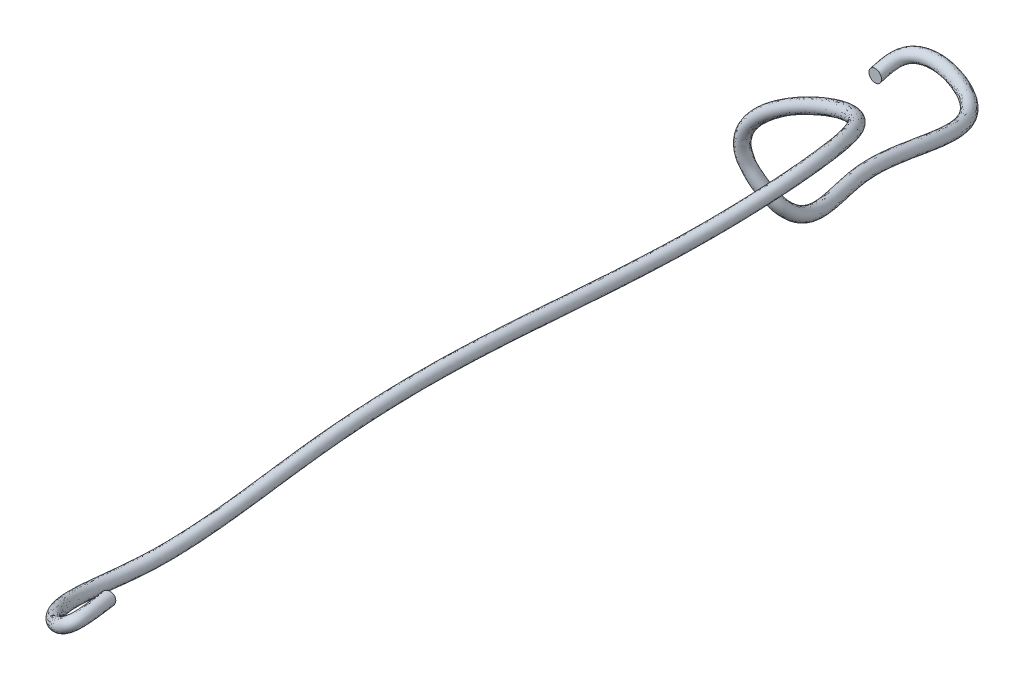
ISO-10303-21;
HEADER;
FILE_DESCRIPTION(('STEP AP214'),'2;1');
FILE_NAME('part.step','',(''),(''),'','','');
FILE_SCHEMA(('AUTOMOTIVE_DESIGN { 1 0 10303 214 1 1 1 1 }'));
ENDSEC;
DATA;
#1=APPLICATION_CONTEXT('core data for automotive mechanical design processes');
#2=APPLICATION_PROTOCOL_DEFINITION('international standard','automotive_design',2000,#1);
#3=PRODUCT_CONTEXT('',#1,'mechanical');
#4=PRODUCT('Part','Part','',(#3));
#5=PRODUCT_RELATED_PRODUCT_CATEGORY('part','',(#4));
#6=PRODUCT_DEFINITION_FORMATION('','',#4);
#7=PRODUCT_DEFINITION_CONTEXT('part definition',#1,'design');
#8=PRODUCT_DEFINITION('design','',#6,#7);
#9=PRODUCT_DEFINITION_SHAPE('','',#8);
#10=(LENGTH_UNIT() NAMED_UNIT(*) SI_UNIT(.MILLI.,.METRE.));
#11=(NAMED_UNIT(*) PLANE_ANGLE_UNIT() SI_UNIT($,.RADIAN.));
#12=(NAMED_UNIT(*) SI_UNIT($,.STERADIAN.) SOLID_ANGLE_UNIT());
#13=UNCERTAINTY_MEASURE_WITH_UNIT(LENGTH_MEASURE(1.E-05),#10,'distance_accuracy_value','');
#14=(GEOMETRIC_REPRESENTATION_CONTEXT(3) GLOBAL_UNCERTAINTY_ASSIGNED_CONTEXT((#13)) GLOBAL_UNIT_ASSIGNED_CONTEXT((#10,
#11,#12)) REPRESENTATION_CONTEXT('',''));
#15=CARTESIAN_POINT('',(0.,0.,0.));
#16=DIRECTION('',(0.,0.,1.));
#17=DIRECTION('',(1.,0.,0.));
#18=AXIS2_PLACEMENT_3D('',#15,#16,#17);
#19=CARTESIAN_POINT('',(-30.8050491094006,-25.8101111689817,-91.7256134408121));
#20=DIRECTION('',(0.,0.,1.));
#21=DIRECTION('',(1.,0.,0.));
#22=AXIS2_PLACEMENT_3D('',#19,#20,#21);
#23=PLANE('',#22);
#24=CARTESIAN_POINT('',(-30.8050491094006,-25.3101111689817,-91.7256134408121));
#25=DIRECTION('',(0.,0.,-1.));
#26=DIRECTION('',(-1.,0.,0.));
#27=AXIS2_PLACEMENT_3D('',#24,#25,#26);
#28=CIRCLE('',#27,0.5);
#29=CARTESIAN_POINT('',(-31.3050491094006,-25.3101111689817,-91.7256134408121));
#30=VERTEX_POINT('',#29);
#31=EDGE_CURVE('E46',#30,#30,#28,.T.);
#32=ORIENTED_EDGE('',*,*,#31,.F.);
#33=EDGE_LOOP('',(#32));
#34=FACE_BOUND('',#33,.T.);
#35=ADVANCED_FACE('F42',(#34),#23,.T.);
#36=CARTESIAN_POINT('',(-0.468553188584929,-0.0688810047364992,0.160353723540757));
#37=DIRECTION('',(0.298607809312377,0.159345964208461,0.940979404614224));
#38=DIRECTION('',(0.953158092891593,0.,-0.302472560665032));
#39=AXIS2_PLACEMENT_3D('',#36,#37,#38);
#40=PLANE('',#39);
#41=CARTESIAN_POINT('',(0.,0.,0.));
#42=DIRECTION('',(0.298607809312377,0.159345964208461,0.940979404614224));
#43=DIRECTION('',(0.953158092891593,0.,-0.302472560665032));
#44=AXIS2_PLACEMENT_3D('',#41,#42,#43);
#45=CIRCLE('',#44,0.5);
#46=CARTESIAN_POINT('',(0.476579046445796,0.,-0.151236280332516));
#47=VERTEX_POINT('',#46);
#48=EDGE_CURVE('E11',#47,#47,#45,.T.);
#49=ORIENTED_EDGE('',*,*,#48,.F.);
#50=EDGE_LOOP('',(#49));
#51=FACE_BOUND('',#50,.T.);
#52=ADVANCED_FACE('F44',(#51),#40,.F.);
#53=CARTESIAN_POINT('',(-30.8050491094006,-24.8101111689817,-91.7256134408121));
#54=CARTESIAN_POINT('',(-30.8286368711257,-24.7723173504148,-91.9692451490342));
#55=CARTESIAN_POINT('',(-30.8758123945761,-24.6967297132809,-92.4565085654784));
#56=CARTESIAN_POINT('',(-30.8744043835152,-24.5913158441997,-93.0790604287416));
#57=CARTESIAN_POINT('',(-30.7886345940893,-24.5189352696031,-93.4355183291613));
#58=CARTESIAN_POINT('',(-30.6783812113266,-24.4642014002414,-93.6649266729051));
#59=CARTESIAN_POINT('',(-30.5604836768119,-24.4194596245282,-93.8271355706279));
#60=CARTESIAN_POINT('',(-30.3648505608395,-24.3632351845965,-93.9876531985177));
#61=CARTESIAN_POINT('',(-30.1283369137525,-24.3072269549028,-94.1062951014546));
#62=CARTESIAN_POINT('',(-29.8216098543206,-24.2442956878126,-94.1960352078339));
#63=CARTESIAN_POINT('',(-29.431369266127,-24.1736732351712,-94.2432498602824));
#64=CARTESIAN_POINT('',(-28.9487570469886,-24.0946303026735,-94.2341034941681));
#65=CARTESIAN_POINT('',(-28.0670946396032,-23.9595610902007,-94.1253856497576));
#66=CARTESIAN_POINT('',(-26.6687793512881,-23.7600240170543,-93.7345660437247));
#67=CARTESIAN_POINT('',(-25.1581597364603,-23.5399161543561,-93.0663809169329));
#68=CARTESIAN_POINT('',(-24.212156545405,-23.3728853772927,-92.4770927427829));
#69=CARTESIAN_POINT('',(-23.4780428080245,-23.2175068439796,-91.9189234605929));
#70=CARTESIAN_POINT('',(-22.7738361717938,-23.0183862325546,-91.1925204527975));
#71=CARTESIAN_POINT('',(-22.1204567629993,-22.7572820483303,-90.2418198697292));
#72=CARTESIAN_POINT('',(-21.6659360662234,-22.4865540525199,-89.2365545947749));
#73=CARTESIAN_POINT('',(-20.9904034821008,-21.8484080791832,-86.7753062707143));
#74=CARTESIAN_POINT('',(-21.0838696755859,-21.1383771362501,-83.7580490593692));
#75=CARTESIAN_POINT('',(-20.2613901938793,-20.3785325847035,-79.4104181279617));
#76=CARTESIAN_POINT('',(-19.1681192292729,-20.0722868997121,-76.7595582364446));
#77=CARTESIAN_POINT('',(-18.7323638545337,-19.5667399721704,-74.7807531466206));
#78=CARTESIAN_POINT('',(-18.5769533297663,-19.2544110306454,-73.9433356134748));
#79=CARTESIAN_POINT('',(-18.5566447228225,-18.9076468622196,-73.2977823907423));
#80=CARTESIAN_POINT('',(-18.6422615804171,-18.539907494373,-72.820516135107));
#81=CARTESIAN_POINT('',(-18.7771812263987,-18.2577726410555,-72.5424068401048));
#82=CARTESIAN_POINT('',(-18.9289179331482,-17.9690211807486,-72.3402827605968));
#83=CARTESIAN_POINT('',(-19.0909133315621,-17.6331044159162,-72.1546348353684));
#84=CARTESIAN_POINT('',(-19.2233126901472,-16.8968732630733,-71.8000273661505));
#85=CARTESIAN_POINT('',(-19.9112888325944,-16.2154765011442,-71.6454537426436));
#86=CARTESIAN_POINT('',(-20.0233939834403,-15.5427149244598,-71.4054093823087));
#87=CARTESIAN_POINT('',(-20.0946302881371,-15.0376661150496,-71.2778351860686));
#88=CARTESIAN_POINT('',(-20.1806289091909,-14.6387475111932,-71.2385835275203));
#89=CARTESIAN_POINT('',(-20.1212305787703,-14.1082047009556,-71.174742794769));
#90=CARTESIAN_POINT('',(-19.9265559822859,-13.4756371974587,-71.1270874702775));
#91=CARTESIAN_POINT('',(-19.4774638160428,-12.726208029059,-71.0882327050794));
#92=CARTESIAN_POINT('',(-18.6765131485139,-11.8743263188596,-71.046171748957));
#93=CARTESIAN_POINT('',(-17.1667635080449,-10.6907283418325,-70.9475558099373));
#94=CARTESIAN_POINT('',(-15.1084138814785,-9.51305495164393,-70.5500554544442));
#95=CARTESIAN_POINT('',(-12.9287654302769,-8.20780046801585,-69.9668022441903));
#96=CARTESIAN_POINT('',(-11.2652114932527,-7.31080506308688,-69.4339101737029));
#97=CARTESIAN_POINT('',(-10.2908139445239,-6.78345678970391,-68.9261374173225));
#98=CARTESIAN_POINT('',(-9.40481773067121,-6.31796186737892,-68.3380846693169));
#99=CARTESIAN_POINT('',(-8.42987075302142,-5.82844731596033,-67.5171038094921));
#100=CARTESIAN_POINT('',(-7.39154733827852,-5.23658369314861,-65.9428050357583));
#101=CARTESIAN_POINT('',(-6.81061296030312,-4.95277088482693,-64.5612487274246));
#102=CARTESIAN_POINT('',(-6.39154035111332,-4.75650017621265,-63.1321345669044));
#103=CARTESIAN_POINT('',(-6.14838655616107,-4.64425039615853,-61.5508842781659));
#104=CARTESIAN_POINT('',(-6.03563306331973,-4.70384303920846,-58.2600952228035));
#105=CARTESIAN_POINT('',(-6.25607066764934,-5.04485144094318,-54.9090850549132));
#106=CARTESIAN_POINT('',(-6.56105774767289,-5.30376674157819,-47.8753059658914));
#107=CARTESIAN_POINT('',(-6.66746945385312,-4.72866466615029,-40.9154716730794));
#108=CARTESIAN_POINT('',(-6.67902420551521,-4.19774143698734,-31.4857506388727));
#109=CARTESIAN_POINT('',(-6.63536273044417,-4.42603247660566,-23.6467166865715));
#110=CARTESIAN_POINT('',(-6.10914279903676,-5.26872859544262,-15.5931010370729));
#111=CARTESIAN_POINT('',(-5.87838146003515,-5.54547443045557,-9.88689501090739));
#112=CARTESIAN_POINT('',(-6.08225408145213,-5.29024865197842,-6.37330513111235));
#113=CARTESIAN_POINT('',(-6.05684395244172,-4.88654097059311,-4.22314964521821));
#114=CARTESIAN_POINT('',(-5.70341329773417,-4.41080925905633,-2.45187692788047));
#115=CARTESIAN_POINT('',(-5.01843890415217,-3.77318614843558,-0.784804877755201));
#116=CARTESIAN_POINT('',(-4.2507552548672,-3.17993970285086,0.377160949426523));
#117=CARTESIAN_POINT('',(-3.27555871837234,-2.53205218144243,1.52090268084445));
#118=CARTESIAN_POINT('',(-2.34209964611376,-1.99230819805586,2.37408571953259));
#119=CARTESIAN_POINT('',(-1.31283970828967,-1.35657912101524,3.07890306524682));
#120=CARTESIAN_POINT('',(-0.763691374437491,-1.01150074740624,3.34801365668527));
#121=CARTESIAN_POINT('',(-0.348458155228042,-0.742708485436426,3.45609770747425));
#122=CARTESIAN_POINT('',(-0.0947504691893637,-0.574341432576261,3.46694363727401));
#123=CARTESIAN_POINT('',(0.105507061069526,-0.437817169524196,3.42678630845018));
#124=CARTESIAN_POINT('',(0.252317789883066,-0.335466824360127,3.36647929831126));
#125=CARTESIAN_POINT('',(0.390727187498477,-0.236203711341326,3.27089475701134));
#126=CARTESIAN_POINT('',(0.512230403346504,-0.145563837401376,3.13931213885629));
#127=CARTESIAN_POINT('',(0.577748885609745,-0.094113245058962,3.02878530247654));
#128=CARTESIAN_POINT('',(0.631772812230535,-0.0496149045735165,2.91466446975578));
#129=CARTESIAN_POINT('',(0.675681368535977,-0.0110887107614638,2.79559063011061));
#130=CARTESIAN_POINT('',(0.717008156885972,0.0298866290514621,2.61678863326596));
#131=CARTESIAN_POINT('',(0.741622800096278,0.0601164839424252,2.43259955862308));
#132=CARTESIAN_POINT('',(0.764366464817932,0.102975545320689,2.06083198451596));
#133=CARTESIAN_POINT('',(0.712691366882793,0.128215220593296,1.2523722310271));
#134=CARTESIAN_POINT('',(0.563919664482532,0.0920584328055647,0.391492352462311));
#135=CARTESIAN_POINT('',(0.468553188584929,0.0688810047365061,-0.160353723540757));
#136=CARTESIAN_POINT('',(-29.8050491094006,-24.8101111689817,-91.7256134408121));
#137=CARTESIAN_POINT('',(-29.828800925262,-24.7736602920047,-91.961558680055));
#138=CARTESIAN_POINT('',(-29.8763045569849,-24.7007585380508,-92.4334491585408));
#139=CARTESIAN_POINT('',(-29.8772280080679,-24.6151547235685,-92.9389738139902));
#140=CARTESIAN_POINT('',(-29.8450286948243,-24.5861972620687,-93.0878012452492));
#141=CARTESIAN_POINT('',(-29.8321294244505,-24.5732596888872,-93.1353632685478));
#142=CARTESIAN_POINT('',(-29.8355416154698,-24.5678488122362,-93.1375316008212));
#143=CARTESIAN_POINT('',(-29.8347533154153,-24.5588998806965,-93.1518168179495));
#144=CARTESIAN_POINT('',(-29.7932612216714,-24.5388268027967,-93.1861381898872));
#145=CARTESIAN_POINT('',(-29.6732992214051,-24.5012126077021,-93.2353848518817));
#146=CARTESIAN_POINT('',(-29.4427449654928,-24.442340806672,-93.2763492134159));
#147=CARTESIAN_POINT('',(-29.0890444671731,-24.3610982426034,-93.2782680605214));
#148=CARTESIAN_POINT('',(-28.3712621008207,-24.201655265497,-93.1974316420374));
#149=CARTESIAN_POINT('',(-27.1191741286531,-23.9199578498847,-92.8458434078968));
#150=CARTESIAN_POINT('',(-25.732098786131,-23.5385060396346,-92.2416799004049));
#151=CARTESIAN_POINT('',(-24.8744377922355,-23.3178019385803,-91.7277725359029));
#152=CARTESIAN_POINT('',(-24.2165534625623,-23.1524486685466,-91.2448678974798));
#153=CARTESIAN_POINT('',(-23.5979139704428,-23.0125359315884,-90.6162534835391));
#154=CARTESIAN_POINT('',(-23.0276495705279,-22.803268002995,-89.8125195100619));
#155=CARTESIAN_POINT('',(-22.6221804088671,-22.594094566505,-88.9493017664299));
#156=CARTESIAN_POINT('',(-21.9757086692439,-22.1301874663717,-86.75493836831));
#157=CARTESIAN_POINT('',(-22.0529058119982,-21.4275494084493,-83.7664753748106));
#158=CARTESIAN_POINT('',(-21.253270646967,-20.4326634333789,-79.2592395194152));
#159=CARTESIAN_POINT('',(-20.1604818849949,-20.0621937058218,-76.5011153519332));
#160=CARTESIAN_POINT('',(-19.6584389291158,-19.8727278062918,-74.546246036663));
#161=CARTESIAN_POINT('',(-19.4860678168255,-19.6234387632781,-73.7455464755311));
#162=CARTESIAN_POINT('',(-19.4421427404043,-19.3497642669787,-73.1502823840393));
#163=CARTESIAN_POINT('',(-19.4983868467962,-19.0567202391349,-72.7284934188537));
#164=CARTESIAN_POINT('',(-19.5810098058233,-18.83756901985,-72.4695218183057));
#165=CARTESIAN_POINT('',(-19.7247703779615,-18.5900351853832,-72.299984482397));
#166=CARTESIAN_POINT('',(-19.8912683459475,-18.2604731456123,-72.2049383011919));
#167=CARTESIAN_POINT('',(-19.960607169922,-17.2841430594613,-72.4442062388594));
#168=CARTESIAN_POINT('',(-20.7391257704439,-16.7772339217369,-71.9150078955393));
#169=CARTESIAN_POINT('',(-20.7205778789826,-15.8457547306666,-72.0261200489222));
#170=CARTESIAN_POINT('',(-20.759768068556,-15.1786908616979,-72.0334747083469));
#171=CARTESIAN_POINT('',(-20.9025795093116,-14.7119205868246,-71.9229369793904));
#172=CARTESIAN_POINT('',(-20.8319475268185,-14.0363028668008,-71.8811701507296));
#173=CARTESIAN_POINT('',(-20.602414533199,-13.2636243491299,-71.8368232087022));
#174=CARTESIAN_POINT('',(-20.068737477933,-12.4017456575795,-71.8322687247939));
#175=CARTESIAN_POINT('',(-19.1521508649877,-11.5146676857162,-71.8501471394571));
#176=CARTESIAN_POINT('',(-17.452793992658,-10.3882073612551,-71.8881502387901));
#177=CARTESIAN_POINT('',(-14.998407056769,-9.71249006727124,-71.6132037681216));
#178=CARTESIAN_POINT('',(-12.579286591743,-8.81772415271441,-70.7017341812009));
#179=CARTESIAN_POINT('',(-10.8332303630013,-8.01289271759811,-70.0061830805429));
#180=CARTESIAN_POINT('',(-9.79758702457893,-7.51428067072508,-69.4005343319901));
#181=CARTESIAN_POINT('',(-8.83537861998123,-7.02222706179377,-68.7644402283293));
#182=CARTESIAN_POINT('',(-7.74715275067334,-6.42704464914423,-67.9510741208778));
#183=CARTESIAN_POINT('',(-6.58948290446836,-5.72917443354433,-66.3117968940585));
#184=CARTESIAN_POINT('',(-5.92586581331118,-5.27053821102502,-64.8982256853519));
#185=CARTESIAN_POINT('',(-5.45773337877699,-4.99315344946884,-63.4143360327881));
#186=CARTESIAN_POINT('',(-5.20786646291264,-4.93289168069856,-61.7415598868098));
#187=CARTESIAN_POINT('',(-5.12798067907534,-5.12026659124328,-58.3612333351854));
#188=CARTESIAN_POINT('',(-5.34206588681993,-5.44922756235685,-54.9821731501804));
#189=CARTESIAN_POINT('',(-5.62099071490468,-5.63736635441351,-47.9270358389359));
#190=CARTESIAN_POINT('',(-5.72516199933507,-5.07541625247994,-40.9616262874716));
#191=CARTESIAN_POINT('',(-5.80009522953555,-4.65446590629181,-31.6123146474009));
#192=CARTESIAN_POINT('',(-5.80543523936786,-4.95736664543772,-23.8484552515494));
#193=CARTESIAN_POINT('',(-5.22756559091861,-5.69801420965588,-15.7791876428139));
#194=CARTESIAN_POINT('',(-4.8535687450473,-5.72136080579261,-9.95874552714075));
#195=CARTESIAN_POINT('',(-5.12976228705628,-5.61317664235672,-6.43626864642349));
#196=CARTESIAN_POINT('',(-5.23403212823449,-5.45938347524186,-4.31756479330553));
#197=CARTESIAN_POINT('',(-4.94655020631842,-5.05058237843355,-2.59088645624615));
#198=CARTESIAN_POINT('',(-4.33249587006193,-4.47884626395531,-0.97039879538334));
#199=CARTESIAN_POINT('',(-3.61947493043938,-3.93351922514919,0.183864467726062));
#200=CARTESIAN_POINT('',(-2.66492950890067,-3.28185678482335,1.26761494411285));
#201=CARTESIAN_POINT('',(-1.71047417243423,-2.68304485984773,2.0146485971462));
#202=CARTESIAN_POINT('',(-0.724884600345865,-2.04445621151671,2.65265027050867));
#203=CARTESIAN_POINT('',(-0.221068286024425,-1.71692955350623,2.88990433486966));
#204=CARTESIAN_POINT('',(0.128118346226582,-1.48613749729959,2.98519565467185));
#205=CARTESIAN_POINT('',(0.321228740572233,-1.35637882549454,3.00039607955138));
#206=CARTESIAN_POINT('',(0.458948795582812,-1.26199858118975,2.9827094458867));
#207=CARTESIAN_POINT('',(0.553440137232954,-1.19609766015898,2.95343763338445));
#208=CARTESIAN_POINT('',(0.638435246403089,-1.13542182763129,2.90687243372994));
#209=CARTESIAN_POINT('',(0.713139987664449,-1.08037286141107,2.84181608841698));
#210=CARTESIAN_POINT('',(0.755409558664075,-1.04772810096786,2.78416015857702));
#211=CARTESIAN_POINT('',(0.793080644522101,-1.01774282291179,2.72109910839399));
#212=CARTESIAN_POINT('',(0.826879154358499,-0.98988097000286,2.65195170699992));
#213=CARTESIAN_POINT('',(0.86395653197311,-0.956031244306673,2.53159486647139));
#214=CARTESIAN_POINT('',(0.889922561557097,-0.928345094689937,2.39370336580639));
#215=CARTESIAN_POINT('',(0.92030533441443,-0.885521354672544,2.09175078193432));
#216=CARTESIAN_POINT('',(0.888935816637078,-0.85157935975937,1.34990159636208));
#217=CARTESIAN_POINT('',(0.742900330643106,-0.886376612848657,0.495516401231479));
#218=CARTESIAN_POINT('',(0.649287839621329,-0.908682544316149,-0.0521664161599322));
#219=CARTESIAN_POINT('',(-29.8050491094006,-25.8101111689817,-91.7256134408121));
#220=CARTESIAN_POINT('',(-29.8300955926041,-25.7736475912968,-91.9626991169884));
#221=CARTESIAN_POINT('',(-29.8801885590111,-25.7007204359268,-92.4368704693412));
#222=CARTESIAN_POINT('',(-29.9003141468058,-25.6150747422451,-92.9592522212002));
#223=CARTESIAN_POINT('',(-29.8965839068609,-25.5834061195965,-93.1472280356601));
#224=CARTESIAN_POINT('',(-29.8986633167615,-25.5661799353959,-93.2357330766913));
#225=CARTESIAN_POINT('',(-29.9081225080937,-25.5556613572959,-93.2785696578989));
#226=CARTESIAN_POINT('',(-29.9014020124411,-25.5387565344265,-93.3419634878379));
#227=CARTESIAN_POINT('',(-29.843588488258,-25.5113209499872,-93.4145681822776));
#228=CARTESIAN_POINT('',(-29.7013442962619,-25.4677112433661,-93.4911978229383));
#229=CARTESIAN_POINT('',(-29.4471876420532,-25.4055932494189,-93.5452140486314));
#230=CARTESIAN_POINT('',(-29.0730332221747,-25.3247427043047,-93.5452761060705));
#231=CARTESIAN_POINT('',(-28.3318355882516,-25.1712425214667,-93.4397798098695));
#232=CARTESIAN_POINT('',(-27.0751782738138,-24.9113726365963,-93.0044319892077));
#233=CARTESIAN_POINT('',(-25.7435007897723,-24.5398725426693,-92.2495951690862));
#234=CARTESIAN_POINT('',(-24.9032008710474,-24.3169162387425,-91.6801831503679));
#235=CARTESIAN_POINT('',(-24.2404845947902,-24.1495201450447,-91.1759426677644));
#236=CARTESIAN_POINT('',(-23.5719989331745,-24.0119992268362,-90.571045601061));
#237=CARTESIAN_POINT('',(-22.9534489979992,-23.7996357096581,-89.7654865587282));
#238=CARTESIAN_POINT('',(-22.4957187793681,-23.5857693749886,-88.9026701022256));
#239=CARTESIAN_POINT('',(-21.6946759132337,-23.0953517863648,-86.7059054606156));
#240=CARTESIAN_POINT('',(-21.7596353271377,-22.3862908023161,-83.7519546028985));
#241=CARTESIAN_POINT('',(-21.2042622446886,-21.4460375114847,-79.2847223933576));
#242=CARTESIAN_POINT('',(-20.1759017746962,-21.0904183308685,-76.5232727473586));
#243=CARTESIAN_POINT('',(-19.3328356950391,-20.822354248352,-74.5033890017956));
#244=CARTESIAN_POINT('',(-19.0802857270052,-20.528528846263,-73.5846929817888));
#245=CARTESIAN_POINT('',(-18.9683146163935,-20.1755979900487,-72.8204063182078));
#246=CARTESIAN_POINT('',(-19.0074001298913,-19.7638749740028,-72.199502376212));
#247=CARTESIAN_POINT('',(-19.1000316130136,-19.4190443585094,-71.8160040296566));
#248=CARTESIAN_POINT('',(-19.2953741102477,-19.0858144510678,-71.5307192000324));
#249=CARTESIAN_POINT('',(-19.5819916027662,-18.7148698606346,-71.3440391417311));
#250=CARTESIAN_POINT('',(-20.2561623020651,-17.9592300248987,-71.6921292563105));
#251=CARTESIAN_POINT('',(-20.7430443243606,-17.2261609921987,-70.9754117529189));
#252=CARTESIAN_POINT('',(-21.1613526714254,-16.3362520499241,-71.2997147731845));
#253=CARTESIAN_POINT('',(-21.4119392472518,-15.6107499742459,-71.3817990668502));
#254=CARTESIAN_POINT('',(-21.5559052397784,-14.9888602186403,-71.2172073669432));
#255=CARTESIAN_POINT('',(-21.5483403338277,-14.1400216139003,-71.1814948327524));
#256=CARTESIAN_POINT('',(-21.3187487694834,-13.155313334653,-71.1370775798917));
#257=CARTESIAN_POINT('',(-20.7582665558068,-12.1017747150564,-71.1625839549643));
#258=CARTESIAN_POINT('',(-19.8145784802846,-11.0530704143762,-71.2553333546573));
#259=CARTESIAN_POINT('',(-18.118731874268,-9.7170023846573,-71.4726860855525));
#260=CARTESIAN_POINT('',(-15.6488235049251,-8.86515202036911,-71.8369478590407));
#261=CARTESIAN_POINT('',(-12.9379485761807,-8.17455632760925,-71.4062405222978));
#262=CARTESIAN_POINT('',(-11.004067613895,-7.45387574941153,-70.8265689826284));
#263=CARTESIAN_POINT('',(-9.80612416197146,-6.97615723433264,-70.2450345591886));
#264=CARTESIAN_POINT('',(-8.72774261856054,-6.44635497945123,-69.5779768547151));
#265=CARTESIAN_POINT('',(-7.5601618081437,-5.72738052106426,-68.6544805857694));
#266=CARTESIAN_POINT('',(-6.3293378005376,-4.91790317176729,-66.8555526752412));
#267=CARTESIAN_POINT('',(-5.75185102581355,-4.3702849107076,-65.2961161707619));
#268=CARTESIAN_POINT('',(-5.29884785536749,-4.04257605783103,-63.6960778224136));
#269=CARTESIAN_POINT('',(-4.95331855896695,-3.98238878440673,-61.9428156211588));
#270=CARTESIAN_POINT('',(-4.71279368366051,-4.20595277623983,-58.4238228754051));
#271=CARTESIAN_POINT('',(-4.9397500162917,-4.53263804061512,-55.0572398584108));
#272=CARTESIAN_POINT('',(-5.30444158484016,-4.70415276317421,-48.0951114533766));
#273=CARTESIAN_POINT('',(-5.39701710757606,-4.15051882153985,-41.1829320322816));
#274=CARTESIAN_POINT('',(-5.37126014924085,-3.77945232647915,-31.8077275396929));
#275=CARTESIAN_POINT('',(-5.30696420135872,-4.11312372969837,-23.9865419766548));
#276=CARTESIAN_POINT('',(-4.81776281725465,-4.79885841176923,-15.8777222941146));
#277=CARTESIAN_POINT('',(-4.66946158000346,-4.69696655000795,-10.0695309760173));
#278=CARTESIAN_POINT('',(-4.8282788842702,-4.68195852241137,-6.67625038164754));
#279=CARTESIAN_POINT('',(-4.72478711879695,-4.67400526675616,-4.69319926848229));
#280=CARTESIAN_POINT('',(-4.4512308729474,-4.35724507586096,-3.12391876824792));
#281=CARTESIAN_POINT('',(-3.89252960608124,-3.8810463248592,-1.64797629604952));
#282=CARTESIAN_POINT('',(-3.23219846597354,-3.41342898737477,-0.580955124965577));
#283=CARTESIAN_POINT('',(-2.38276660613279,-2.77842779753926,0.449367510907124));
#284=CARTESIAN_POINT('',(-1.56652970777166,-2.12568410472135,1.18959680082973));
#285=CARTESIAN_POINT('',(-0.725510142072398,-1.51889293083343,1.79980744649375));
#286=CARTESIAN_POINT('',(-0.334113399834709,-1.24016854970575,2.01300882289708));
#287=CARTESIAN_POINT('',(-0.128767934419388,-1.09341747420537,2.09804188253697));
#288=CARTESIAN_POINT('',(-0.0650305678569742,-1.04626594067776,2.12572474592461));
#289=CARTESIAN_POINT('',(-0.0611907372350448,-1.04195293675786,2.15362522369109));
#290=CARTESIAN_POINT('',(-0.0795292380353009,-1.05435629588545,2.18654943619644));
#291=CARTESIAN_POINT('',(-0.111030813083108,-1.07732924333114,2.23902414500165));
#292=CARTESIAN_POINT('',(-0.140602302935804,-1.1007604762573,2.30980461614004));
#293=CARTESIAN_POINT('',(-0.150931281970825,-1.11003984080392,2.36206449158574));
#294=CARTESIAN_POINT('',(-0.152489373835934,-1.11369437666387,2.40467696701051));
#295=CARTESIAN_POINT('',(-0.145870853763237,-1.11208755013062,2.43842762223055));
#296=CARTESIAN_POINT('',(-0.123829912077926,-1.09728740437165,2.4405156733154));
#297=CARTESIAN_POINT('',(-0.100010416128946,-1.07831491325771,2.40012443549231));
#298=CARTESIAN_POINT('',(-0.0609262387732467,-1.04060320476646,2.24617392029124));
#299=CARTESIAN_POINT('',(-0.0565286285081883,-0.993252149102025,1.64749618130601));
#300=CARTESIAN_POINT('',(-0.197470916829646,-1.02566627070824,0.807195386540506));
#301=CARTESIAN_POINT('',(-0.287818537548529,-1.04644455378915,0.268541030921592));
#302=CARTESIAN_POINT('',(-30.8050491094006,-25.8101111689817,-91.7256134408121));
#303=CARTESIAN_POINT('',(-30.8299315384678,-25.7723046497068,-91.9703855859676));
#304=CARTESIAN_POINT('',(-30.8796963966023,-25.6966916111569,-92.4599298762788));
#305=CARTESIAN_POINT('',(-30.8974905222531,-25.5912358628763,-93.0993388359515));
#306=CARTESIAN_POINT('',(-30.8401898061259,-25.516144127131,-93.4949451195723));
#307=CARTESIAN_POINT('',(-30.7449151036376,-25.4571216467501,-93.7652964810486));
#308=CARTESIAN_POINT('',(-30.6330645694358,-25.4072721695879,-93.9681736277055));
#309=CARTESIAN_POINT('',(-30.4314992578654,-25.3430918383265,-94.1777998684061));
#310=CARTESIAN_POINT('',(-30.1786641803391,-25.2797211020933,-94.3347250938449));
#311=CARTESIAN_POINT('',(-29.8496549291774,-25.2107943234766,-94.4518481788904));
#312=CARTESIAN_POINT('',(-29.4358119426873,-25.136925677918,-94.5121146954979));
#313=CARTESIAN_POINT('',(-28.9327458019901,-25.0582747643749,-94.5011115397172));
#314=CARTESIAN_POINT('',(-28.0276681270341,-24.9291483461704,-94.3677338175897));
#315=CARTESIAN_POINT('',(-26.6247834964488,-24.7514388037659,-93.8931546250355));
#316=CARTESIAN_POINT('',(-25.1695617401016,-24.5412826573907,-93.0742961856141));
#317=CARTESIAN_POINT('',(-24.2409196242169,-24.3719996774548,-92.4295033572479));
#318=CARTESIAN_POINT('',(-23.5019739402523,-24.2145783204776,-91.8499982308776));
#319=CARTESIAN_POINT('',(-22.7479211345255,-24.0178495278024,-91.1473125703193));
#320=CARTESIAN_POINT('',(-22.0462561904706,-23.7536497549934,-90.1947869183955));
#321=CARTESIAN_POINT('',(-21.5394744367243,-23.4782288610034,-89.1899229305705));
#322=CARTESIAN_POINT('',(-20.7093707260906,-22.8135723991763,-86.7262733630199));
#323=CARTESIAN_POINT('',(-20.7905991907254,-22.0971185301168,-83.7435282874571));
#324=CARTESIAN_POINT('',(-20.2123817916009,-21.3919066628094,-79.4359010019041));
#325=CARTESIAN_POINT('',(-19.1835391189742,-21.1005115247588,-76.78171563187));
#326=CARTESIAN_POINT('',(-18.4067606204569,-20.5163664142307,-74.7378961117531));
#327=CARTESIAN_POINT('',(-18.1711712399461,-20.1595011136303,-73.7824821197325));
#328=CARTESIAN_POINT('',(-18.0828165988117,-19.7334805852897,-72.9679063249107));
#329=CARTESIAN_POINT('',(-18.1512748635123,-19.2470622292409,-72.2915250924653));
#330=CARTESIAN_POINT('',(-18.2962030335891,-18.8392479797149,-71.8888890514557));
#331=CARTESIAN_POINT('',(-18.4995216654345,-18.4648004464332,-71.5710174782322));
#332=CARTESIAN_POINT('',(-18.7816365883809,-18.0875011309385,-71.2937356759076));
#333=CARTESIAN_POINT('',(-19.5188678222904,-17.5719602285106,-71.0479503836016));
#334=CARTESIAN_POINT('',(-19.915207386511,-16.664403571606,-70.7058576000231));
#335=CARTESIAN_POINT('',(-20.4641687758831,-16.0332122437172,-70.679004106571));
#336=CARTESIAN_POINT('',(-20.7468014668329,-15.4697252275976,-70.6261595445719));
#337=CARTESIAN_POINT('',(-20.8339546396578,-14.9156871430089,-70.5328539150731));
#338=CARTESIAN_POINT('',(-20.8376233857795,-14.2119234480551,-70.4750674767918));
#339=CARTESIAN_POINT('',(-20.6428902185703,-13.3673261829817,-70.4273418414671));
#340=CARTESIAN_POINT('',(-20.1669928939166,-12.4262370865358,-70.4185479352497));
#341=CARTESIAN_POINT('',(-19.3389407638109,-11.4127290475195,-70.4513579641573));
#342=CARTESIAN_POINT('',(-17.8327013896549,-10.0195233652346,-70.5320916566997));
#343=CARTESIAN_POINT('',(-15.7588303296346,-8.6657169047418,-70.7737995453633));
#344=CARTESIAN_POINT('',(-13.2874274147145,-7.56463264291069,-70.6713085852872));
#345=CARTESIAN_POINT('',(-11.4360487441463,-6.75178809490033,-70.2542960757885));
#346=CARTESIAN_POINT('',(-10.2993510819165,-6.24533335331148,-69.7706376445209));
#347=CARTESIAN_POINT('',(-9.29718172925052,-5.74208978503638,-69.1516212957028));
#348=CARTESIAN_POINT('',(-8.2428798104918,-5.12878318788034,-68.2205102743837));
#349=CARTESIAN_POINT('',(-7.13140223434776,-4.42531243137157,-66.4865608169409));
#350=CARTESIAN_POINT('',(-6.63659817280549,-4.05251758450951,-64.9591392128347));
#351=CARTESIAN_POINT('',(-6.23265482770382,-3.80592278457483,-63.4138763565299));
#352=CARTESIAN_POINT('',(-5.89383865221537,-3.69374749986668,-61.7521400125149));
#353=CARTESIAN_POINT('',(-5.62044606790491,-3.78952922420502,-58.3226847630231));
#354=CARTESIAN_POINT('',(-5.85375479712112,-4.12826191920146,-54.9841517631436));
#355=CARTESIAN_POINT('',(-6.24450861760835,-4.37055315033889,-48.0433815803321));
#356=CARTESIAN_POINT('',(-6.33932456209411,-3.8037672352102,-41.1367774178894));
#357=CARTESIAN_POINT('',(-6.2501891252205,-3.32272785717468,-31.6811635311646));
#358=CARTESIAN_POINT('',(-6.13689169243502,-3.58178956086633,-23.7848034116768));
#359=CARTESIAN_POINT('',(-5.69934002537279,-4.36957279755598,-15.6916356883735));
#360=CARTESIAN_POINT('',(-5.69427429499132,-4.52108017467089,-9.99768045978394));
#361=CARTESIAN_POINT('',(-5.78077067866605,-4.35903053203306,-6.61328686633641));
#362=CARTESIAN_POINT('',(-5.54759894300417,-4.10116276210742,-4.59878412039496));
#363=CARTESIAN_POINT('',(-5.20809396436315,-3.71747195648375,-2.98490923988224));
#364=CARTESIAN_POINT('',(-4.57847264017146,-3.17538620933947,-1.46238237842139));
#365=CARTESIAN_POINT('',(-3.86347879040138,-2.65984946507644,-0.387658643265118));
#366=CARTESIAN_POINT('',(-2.99339581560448,-2.02862319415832,0.702655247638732));
#367=CARTESIAN_POINT('',(-2.19815518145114,-1.43494744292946,1.54903392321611));
#368=CARTESIAN_POINT('',(-1.31346525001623,-0.831015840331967,2.2260602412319));
#369=CARTESIAN_POINT('',(-0.876736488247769,-0.534739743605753,2.4711181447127));
#370=CARTESIAN_POINT('',(-0.605344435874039,-0.349988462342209,2.56894393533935));
#371=CARTESIAN_POINT('',(-0.481009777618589,-0.264228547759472,2.59227230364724));
#372=CARTESIAN_POINT('',(-0.414632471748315,-0.21777152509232,2.59770208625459));
#373=CARTESIAN_POINT('',(-0.380651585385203,-0.19372546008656,2.59959110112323));
#374=CARTESIAN_POINT('',(-0.358738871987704,-0.178111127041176,2.60304646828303));
#375=CARTESIAN_POINT('',(-0.341511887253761,-0.165951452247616,2.60730066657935));
#376=CARTESIAN_POINT('',(-0.328591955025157,-0.15642498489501,2.60668963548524));
#377=CARTESIAN_POINT('',(-0.313797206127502,-0.145566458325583,2.59824232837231));
#378=CARTESIAN_POINT('',(-0.297068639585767,-0.133295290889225,2.58206654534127));
#379=CARTESIAN_POINT('',(-0.270778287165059,-0.111369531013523,2.52570944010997));
#380=CARTESIAN_POINT('',(-0.248310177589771,-0.0898533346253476,2.439020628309));
#381=CARTESIAN_POINT('',(-0.216865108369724,-0.0521063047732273,2.21525512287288));
#382=CARTESIAN_POINT('',(-0.232773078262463,-0.0134575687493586,1.54996681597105));
#383=CARTESIAN_POINT('',(-0.376451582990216,-0.0472312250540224,0.703171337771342));
#384=CARTESIAN_POINT('',(-0.468553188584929,-0.0688810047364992,0.160353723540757));
#385=CARTESIAN_POINT('',(-31.8050491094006,-25.8101111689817,-91.7256134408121));
#386=CARTESIAN_POINT('',(-31.8297674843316,-25.7709617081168,-91.9780720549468));
#387=CARTESIAN_POINT('',(-31.8792042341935,-25.692662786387,-92.4829892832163));
#388=CARTESIAN_POINT('',(-31.8946668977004,-25.5673969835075,-93.239425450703));
#389=CARTESIAN_POINT('',(-31.7837957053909,-25.4488821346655,-93.8426622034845));
#390=CARTESIAN_POINT('',(-31.5911668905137,-25.3480633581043,-94.2948598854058));
#391=CARTESIAN_POINT('',(-31.358006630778,-25.2588829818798,-94.6577775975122));
#392=CARTESIAN_POINT('',(-30.9615965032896,-25.1474271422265,-95.0136362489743));
#393=CARTESIAN_POINT('',(-30.5137398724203,-25.0481212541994,-95.2548820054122));
#394=CARTESIAN_POINT('',(-29.9979655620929,-24.9538774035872,-95.4124985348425));
#395=CARTESIAN_POINT('',(-29.4244362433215,-24.8682581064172,-95.4790153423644));
#396=CARTESIAN_POINT('',(-28.7924583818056,-24.791806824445,-95.4569469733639));
#397=CARTESIAN_POINT('',(-27.7235006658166,-24.6870541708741,-95.2956878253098));
#398=CARTESIAN_POINT('',(-26.1743887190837,-24.5915049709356,-94.7818772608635));
#399=CARTESIAN_POINT('',(-24.5956226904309,-24.5426927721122,-93.898997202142));
#400=CARTESIAN_POINT('',(-23.5786383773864,-24.4270831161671,-93.1788235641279));
#401=CARTESIAN_POINT('',(-22.7634632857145,-24.2796364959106,-92.5240537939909));
#402=CARTESIAN_POINT('',(-21.9238433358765,-24.0236998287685,-91.7235795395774));
#403=CARTESIAN_POINT('',(-21.1390633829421,-23.7076638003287,-90.624087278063));
#404=CARTESIAN_POINT('',(-20.5832300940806,-23.3706883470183,-89.4771757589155));
#405=CARTESIAN_POINT('',(-19.7240655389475,-22.5317930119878,-86.746641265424));
#406=CARTESIAN_POINT('',(-19.8215630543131,-21.8079462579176,-83.7351019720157));
#407=CARTESIAN_POINT('',(-19.2205013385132,-21.3377758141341,-79.5870796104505));
#408=CARTESIAN_POINT('',(-18.1911764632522,-21.1106047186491,-77.0401585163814));
#409=CARTESIAN_POINT('',(-17.4806855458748,-20.2103785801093,-74.9724032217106));
#410=CARTESIAN_POINT('',(-17.2620567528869,-19.7904733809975,-73.9802712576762));
#411=CARTESIAN_POINT('',(-17.19731858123,-19.2913631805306,-73.1154063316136));
#412=CARTESIAN_POINT('',(-17.2951495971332,-18.7302494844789,-72.3835478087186));
#413=CARTESIAN_POINT('',(-17.4923744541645,-18.2594516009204,-71.9617740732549));
#414=CARTESIAN_POINT('',(-17.7036692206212,-17.8437864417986,-71.6113157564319));
#415=CARTESIAN_POINT('',(-17.9812815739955,-17.4601324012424,-71.2434322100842));
#416=CARTESIAN_POINT('',(-18.7815733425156,-17.1846904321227,-70.4037715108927));
#417=CARTESIAN_POINT('',(-19.0873704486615,-16.1026461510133,-70.4363034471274));
#418=CARTESIAN_POINT('',(-19.7669848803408,-15.7301724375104,-70.0582934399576));
#419=CARTESIAN_POINT('',(-20.0816636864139,-15.3287004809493,-69.8705200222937));
#420=CARTESIAN_POINT('',(-20.1120040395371,-14.8425140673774,-69.848500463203));
#421=CARTESIAN_POINT('',(-20.1269064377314,-14.2838252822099,-69.7686401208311));
#422=CARTESIAN_POINT('',(-19.9670316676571,-13.5793390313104,-69.7176061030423));
#423=CARTESIAN_POINT('',(-19.5757192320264,-12.7506994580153,-69.6745119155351));
#424=CARTESIAN_POINT('',(-18.8633030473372,-11.7723876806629,-69.6473825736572));
#425=CARTESIAN_POINT('',(-17.5466709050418,-10.322044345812,-69.5914972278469));
#426=CARTESIAN_POINT('',(-15.8688371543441,-8.46628178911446,-69.7106512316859));
#427=CARTESIAN_POINT('',(-13.6369062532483,-6.95470895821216,-69.9363766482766));
#428=CARTESIAN_POINT('',(-11.8680298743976,-6.04970044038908,-69.6820231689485));
#429=CARTESIAN_POINT('',(-10.7925780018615,-5.51450947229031,-69.2962407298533));
#430=CARTESIAN_POINT('',(-9.8666208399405,-5.03782459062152,-68.7252657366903));
#431=CARTESIAN_POINT('',(-8.92559781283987,-4.53018585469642,-67.786539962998));
#432=CARTESIAN_POINT('',(-7.93346666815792,-3.93272169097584,-66.1175689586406));
#433=CARTESIAN_POINT('',(-7.52134531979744,-3.73475025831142,-64.6221622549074));
#434=CARTESIAN_POINT('',(-7.16646180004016,-3.56926951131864,-63.1316748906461));
#435=CARTESIAN_POINT('',(-6.83435874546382,-3.40510621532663,-61.561464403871));
#436=CARTESIAN_POINT('',(-6.52809845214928,-3.37310567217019,-58.2215466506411));
#437=CARTESIAN_POINT('',(-6.76775957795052,-3.72388579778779,-54.9110636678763));
#438=CARTESIAN_POINT('',(-7.18457565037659,-4.03695353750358,-47.9916517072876));
#439=CARTESIAN_POINT('',(-7.28163201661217,-3.45701564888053,-41.0906228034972));
#440=CARTESIAN_POINT('',(-7.12911810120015,-2.86600338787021,-31.5545995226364));
#441=CARTESIAN_POINT('',(-6.96681918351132,-3.05045539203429,-23.5830648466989));
#442=CARTESIAN_POINT('',(-6.58091723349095,-3.94028718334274,-15.5055490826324));
#443=CARTESIAN_POINT('',(-6.7190870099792,-4.34519379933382,-9.92582994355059));
#444=CARTESIAN_POINT('',(-6.73326247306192,-4.03610254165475,-6.55032335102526));
#445=CARTESIAN_POINT('',(-6.37041076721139,-3.52832025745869,-4.50436897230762));
#446=CARTESIAN_POINT('',(-5.96495705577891,-3.07769883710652,-2.84589971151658));
#447=CARTESIAN_POINT('',(-5.26441567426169,-2.46972609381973,-1.27678846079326));
#448=CARTESIAN_POINT('',(-4.49475911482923,-1.90626994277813,-0.194362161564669));
#449=CARTESIAN_POINT('',(-3.60402502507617,-1.27881859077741,0.955942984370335));
#450=CARTESIAN_POINT('',(-2.82978065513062,-0.744210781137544,1.90847104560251));
#451=CARTESIAN_POINT('',(-1.90142035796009,-0.143138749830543,2.65231303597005));
#452=CARTESIAN_POINT('',(-1.41935957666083,0.17068906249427,2.92922746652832));
#453=CARTESIAN_POINT('',(-1.08192093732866,0.393440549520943,3.03984598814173));
#454=CARTESIAN_POINT('',(-0.896988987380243,0.517808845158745,3.05881986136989));
#455=CARTESIAN_POINT('',(-0.768074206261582,0.606409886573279,3.04177894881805));
#456=CARTESIAN_POINT('',(-0.681773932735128,0.666905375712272,3.01263276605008));
#457=CARTESIAN_POINT('',(-0.606446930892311,0.721106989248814,2.96706879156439));
#458=CARTESIAN_POINT('',(-0.54242147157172,0.768857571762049,2.9047967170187));
#459=CARTESIAN_POINT('',(-0.506252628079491,0.797189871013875,2.85131477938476));
#460=CARTESIAN_POINT('',(-0.475105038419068,0.822561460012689,2.7918076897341));
#461=CARTESIAN_POINT('',(-0.448266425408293,0.845496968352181,2.72570546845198));
#462=CARTESIAN_POINT('',(-0.417726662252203,0.874548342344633,2.61090320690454));
#463=CARTESIAN_POINT('',(-0.396609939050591,0.898608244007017,2.47791682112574));
#464=CARTESIAN_POINT('',(-0.37280397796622,0.936390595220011,2.18433632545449));
#465=CARTESIAN_POINT('',(-0.409017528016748,0.966337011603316,1.45243745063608));
#466=CARTESIAN_POINT('',(-0.555432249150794,0.931203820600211,0.599147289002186));
#467=CARTESIAN_POINT('',(-0.649287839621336,0.908682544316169,0.0521664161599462));
#468=CARTESIAN_POINT('',(-31.8050491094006,-24.8101111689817,-91.7256134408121));
#469=CARTESIAN_POINT('',(-31.8284728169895,-24.7709744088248,-91.9769316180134));
#470=CARTESIAN_POINT('',(-31.8753202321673,-24.6927008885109,-92.479567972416));
#471=CARTESIAN_POINT('',(-31.8715807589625,-24.5674769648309,-93.219147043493));
#472=CARTESIAN_POINT('',(-31.7322404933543,-24.4516732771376,-93.7832354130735));
#473=CARTESIAN_POINT('',(-31.5246329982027,-24.3551431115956,-94.1944900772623));
#474=CARTESIAN_POINT('',(-31.2854257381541,-24.2710704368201,-94.5167395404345));
#475=CARTESIAN_POINT('',(-30.8949478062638,-24.1675704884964,-94.8234895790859));
#476=CARTESIAN_POINT('',(-30.4634126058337,-24.0756271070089,-95.0264520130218));
#477=CARTESIAN_POINT('',(-29.9699204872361,-23.9873787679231,-95.156685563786));
#478=CARTESIAN_POINT('',(-29.4199935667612,-23.9050056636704,-95.2101505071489));
#479=CARTESIAN_POINT('',(-28.808469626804,-23.8281623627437,-95.1899389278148));
#480=CARTESIAN_POINT('',(-27.7629271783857,-23.7174669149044,-95.0533396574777));
#481=CARTESIAN_POINT('',(-26.218384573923,-23.600090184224,-94.6232886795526));
#482=CARTESIAN_POINT('',(-24.5842206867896,-23.5413262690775,-93.8910819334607));
#483=CARTESIAN_POINT('',(-23.5498752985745,-23.427968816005,-93.2264129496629));
#484=CARTESIAN_POINT('',(-22.7395321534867,-23.2825650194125,-92.5929790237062));
#485=CARTESIAN_POINT('',(-21.9497583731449,-23.0242365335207,-91.7687874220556));
#486=CARTESIAN_POINT('',(-21.2132639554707,-22.7112960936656,-90.6711202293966));
#487=CARTESIAN_POINT('',(-20.7096917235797,-22.3790135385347,-89.5238074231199));
#488=CARTESIAN_POINT('',(-20.0050982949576,-21.5666286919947,-86.7956741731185));
#489=CARTESIAN_POINT('',(-20.1148335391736,-20.8492048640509,-83.7496227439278));
#490=CARTESIAN_POINT('',(-19.2695097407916,-20.3244017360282,-79.5615967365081));
#491=CARTESIAN_POINT('',(-18.175756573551,-20.0823800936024,-77.018001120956));
#492=CARTESIAN_POINT('',(-17.8062887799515,-19.260752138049,-75.015260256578));
#493=CARTESIAN_POINT('',(-17.6678388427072,-18.8853832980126,-74.1411247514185));
#494=CARTESIAN_POINT('',(-17.6711467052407,-18.4655294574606,-73.4452823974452));
#495=CARTESIAN_POINT('',(-17.786136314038,-18.023094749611,-72.9125388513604));
#496=CARTESIAN_POINT('',(-17.9733526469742,-17.6779762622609,-72.6152918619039));
#497=CARTESIAN_POINT('',(-18.133065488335,-17.348007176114,-72.3805810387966));
#498=CARTESIAN_POINT('',(-18.2905583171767,-17.00573568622,-72.104331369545));
#499=CARTESIAN_POINT('',(-18.4860182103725,-16.5096034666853,-71.1558484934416));
#500=CARTESIAN_POINT('',(-19.0834518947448,-15.6537190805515,-71.3758995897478));
#501=CARTESIAN_POINT('',(-19.3262100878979,-15.239675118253,-70.7846987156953));
#502=CARTESIAN_POINT('',(-19.4294925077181,-14.8966413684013,-70.5221956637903));
#503=CARTESIAN_POINT('',(-19.4586783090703,-14.5655744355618,-70.5542300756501));
#504=CARTESIAN_POINT('',(-19.4105136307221,-14.1801065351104,-70.4683154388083));
#505=CARTESIAN_POINT('',(-19.2506974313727,-13.6876500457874,-70.4173517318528));
#506=CARTESIAN_POINT('',(-18.8861901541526,-13.0506704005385,-70.3441966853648));
#507=CARTESIAN_POINT('',(-18.2008754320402,-12.2339849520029,-70.2421963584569));
#508=CARTESIAN_POINT('',(-16.8807330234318,-10.9932493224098,-70.0069613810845));
#509=CARTESIAN_POINT('',(-15.218420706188,-9.3136198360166,-69.4869071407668));
#510=CARTESIAN_POINT('',(-13.2782442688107,-7.59787678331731,-69.2318703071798));
#511=CARTESIAN_POINT('',(-11.697192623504,-6.60871740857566,-68.861637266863));
#512=CARTESIAN_POINT('',(-10.7840408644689,-6.05263290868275,-68.4517405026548));
#513=CARTESIAN_POINT('',(-9.9742568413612,-5.61369667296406,-67.9117291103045));
#514=CARTESIAN_POINT('',(-9.11258875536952,-5.22984998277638,-67.0831334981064));
#515=CARTESIAN_POINT('',(-8.19361177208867,-4.74399295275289,-65.573813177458));
#516=CARTESIAN_POINT('',(-7.69536010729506,-4.63500355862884,-64.2242717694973));
#517=CARTESIAN_POINT('',(-7.32534732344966,-4.51984690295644,-62.8499331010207));
#518=CARTESIAN_POINT('',(-7.08890664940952,-4.35560911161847,-61.360208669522));
#519=CARTESIAN_POINT('',(-6.94328544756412,-4.28741948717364,-58.1589571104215));
#520=CARTESIAN_POINT('',(-7.17007544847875,-4.64047531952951,-54.8359969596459));
#521=CARTESIAN_POINT('',(-7.50112478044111,-4.97016712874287,-47.8235760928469));
#522=CARTESIAN_POINT('',(-7.60977690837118,-4.38191307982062,-40.8693170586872));
#523=CARTESIAN_POINT('',(-7.55795318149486,-3.74101696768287,-31.3591866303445));
#524=CARTESIAN_POINT('',(-7.46529022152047,-3.89469830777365,-23.4449781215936));
#525=CARTESIAN_POINT('',(-6.99072000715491,-4.83944298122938,-15.4070144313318));
#526=CARTESIAN_POINT('',(-6.90319417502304,-5.36958805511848,-9.81504449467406));
#527=CARTESIAN_POINT('',(-7.03474587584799,-4.9673206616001,-6.31034161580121));
#528=CARTESIAN_POINT('',(-6.87965577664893,-4.31369846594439,-4.12873449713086));
#529=CARTESIAN_POINT('',(-6.46027638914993,-3.77103613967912,-2.31286739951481));
#530=CARTESIAN_POINT('',(-5.70438193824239,-3.06752603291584,-0.599210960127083));
#531=CARTESIAN_POINT('',(-4.88203557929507,-2.42636018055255,0.57045743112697));
#532=CARTESIAN_POINT('',(-3.88618792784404,-1.78224757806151,1.77419041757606));
#533=CARTESIAN_POINT('',(-2.9737251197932,-1.30157153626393,2.73352284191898));
#534=CARTESIAN_POINT('',(-1.90079481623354,-0.668702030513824,3.50515585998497));
#535=CARTESIAN_POINT('',(-1.30631446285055,-0.306071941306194,3.80612297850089));
#536=CARTESIAN_POINT('',(-0.825034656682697,0.000720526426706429,3.92699976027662));
#537=CARTESIAN_POINT('',(-0.510729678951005,0.207695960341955,3.93349119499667));
#538=CARTESIAN_POINT('',(-0.247934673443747,0.386364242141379,3.87086317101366));
#539=CARTESIAN_POINT('',(-0.0488045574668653,0.525164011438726,3.77952096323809));
#540=CARTESIAN_POINT('',(0.143019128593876,0.66301440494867,3.63491708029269));
#541=CARTESIAN_POINT('',(0.311320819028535,0.789245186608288,3.43680818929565));
#542=CARTESIAN_POINT('',(0.40008821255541,0.859501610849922,3.27341044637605));
#543=CARTESIAN_POINT('',(0.470464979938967,0.918513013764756,3.10822983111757));
#544=CARTESIAN_POINT('',(0.524483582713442,0.967703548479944,2.93922955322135));
#545=CARTESIAN_POINT('',(0.570059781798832,1.01580450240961,2.70198240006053));
#546=CARTESIAN_POINT('',(0.593323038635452,1.0485780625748,2.47149575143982));
#547=CARTESIAN_POINT('',(0.608427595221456,1.09147244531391,2.02991318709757));
#548=CARTESIAN_POINT('',(0.536446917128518,1.10800980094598,1.15484286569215));
#549=CARTESIAN_POINT('',(0.384938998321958,1.0704934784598,0.287468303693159));
#550=CARTESIAN_POINT('',(0.287818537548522,1.04644455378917,-0.268541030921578));
#551=CARTESIAN_POINT('',(-30.8050491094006,-24.8101111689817,-91.7256134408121));
#552=CARTESIAN_POINT('',(-30.8286368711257,-24.7723173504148,-91.9692451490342));
#553=CARTESIAN_POINT('',(-30.8758123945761,-24.6967297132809,-92.4565085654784));
#554=CARTESIAN_POINT('',(-30.8744043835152,-24.5913158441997,-93.0790604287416));
#555=CARTESIAN_POINT('',(-30.7886345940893,-24.5189352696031,-93.4355183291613));
#556=CARTESIAN_POINT('',(-30.6783812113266,-24.4642014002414,-93.6649266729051));
#557=CARTESIAN_POINT('',(-30.5604836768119,-24.4194596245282,-93.8271355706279));
#558=CARTESIAN_POINT('',(-30.3648505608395,-24.3632351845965,-93.9876531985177));
#559=CARTESIAN_POINT('',(-30.1283369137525,-24.3072269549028,-94.1062951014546));
#560=CARTESIAN_POINT('',(-29.8216098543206,-24.2442956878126,-94.1960352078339));
#561=CARTESIAN_POINT('',(-29.431369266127,-24.1736732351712,-94.2432498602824));
#562=CARTESIAN_POINT('',(-28.9487570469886,-24.0946303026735,-94.2341034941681));
#563=CARTESIAN_POINT('',(-28.0670946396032,-23.9595610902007,-94.1253856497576));
#564=CARTESIAN_POINT('',(-26.6687793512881,-23.7600240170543,-93.7345660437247));
#565=CARTESIAN_POINT('',(-25.1581597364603,-23.5399161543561,-93.0663809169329));
#566=CARTESIAN_POINT('',(-24.212156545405,-23.3728853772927,-92.4770927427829));
#567=CARTESIAN_POINT('',(-23.4780428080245,-23.2175068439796,-91.9189234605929));
#568=CARTESIAN_POINT('',(-22.7738361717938,-23.0183862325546,-91.1925204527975));
#569=CARTESIAN_POINT('',(-22.1204567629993,-22.7572820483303,-90.2418198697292));
#570=CARTESIAN_POINT('',(-21.6659360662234,-22.4865540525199,-89.2365545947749));
#571=CARTESIAN_POINT('',(-20.9904034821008,-21.8484080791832,-86.7753062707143));
#572=CARTESIAN_POINT('',(-21.0838696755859,-21.1383771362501,-83.7580490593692));
#573=CARTESIAN_POINT('',(-20.2613901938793,-20.3785325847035,-79.4104181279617));
#574=CARTESIAN_POINT('',(-19.1681192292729,-20.0722868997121,-76.7595582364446));
#575=CARTESIAN_POINT('',(-18.7323638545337,-19.5667399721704,-74.7807531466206));
#576=CARTESIAN_POINT('',(-18.5769533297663,-19.2544110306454,-73.9433356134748));
#577=CARTESIAN_POINT('',(-18.5566447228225,-18.9076468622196,-73.2977823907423));
#578=CARTESIAN_POINT('',(-18.6422615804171,-18.539907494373,-72.820516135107));
#579=CARTESIAN_POINT('',(-18.7771812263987,-18.2577726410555,-72.5424068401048));
#580=CARTESIAN_POINT('',(-18.9289179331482,-17.9690211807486,-72.3402827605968));
#581=CARTESIAN_POINT('',(-19.0909133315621,-17.6331044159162,-72.1546348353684));
#582=CARTESIAN_POINT('',(-19.2233126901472,-16.8968732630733,-71.8000273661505));
#583=CARTESIAN_POINT('',(-19.9112888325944,-16.2154765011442,-71.6454537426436));
#584=CARTESIAN_POINT('',(-20.0233939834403,-15.5427149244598,-71.4054093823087));
#585=CARTESIAN_POINT('',(-20.0946302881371,-15.0376661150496,-71.2778351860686));
#586=CARTESIAN_POINT('',(-20.1806289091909,-14.6387475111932,-71.2385835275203));
#587=CARTESIAN_POINT('',(-20.1212305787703,-14.1082047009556,-71.174742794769));
#588=CARTESIAN_POINT('',(-19.9265559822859,-13.4756371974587,-71.1270874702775));
#589=CARTESIAN_POINT('',(-19.4774638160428,-12.726208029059,-71.0882327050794));
#590=CARTESIAN_POINT('',(-18.6765131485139,-11.8743263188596,-71.046171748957));
#591=CARTESIAN_POINT('',(-17.1667635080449,-10.6907283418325,-70.9475558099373));
#592=CARTESIAN_POINT('',(-15.1084138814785,-9.51305495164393,-70.5500554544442));
#593=CARTESIAN_POINT('',(-12.9287654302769,-8.20780046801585,-69.9668022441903));
#594=CARTESIAN_POINT('',(-11.2652114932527,-7.31080506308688,-69.4339101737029));
#595=CARTESIAN_POINT('',(-10.2908139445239,-6.78345678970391,-68.9261374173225));
#596=CARTESIAN_POINT('',(-9.40481773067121,-6.31796186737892,-68.3380846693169));
#597=CARTESIAN_POINT('',(-8.42987075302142,-5.82844731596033,-67.5171038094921));
#598=CARTESIAN_POINT('',(-7.39154733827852,-5.23658369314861,-65.9428050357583));
#599=CARTESIAN_POINT('',(-6.81061296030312,-4.95277088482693,-64.5612487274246));
#600=CARTESIAN_POINT('',(-6.39154035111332,-4.75650017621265,-63.1321345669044));
#601=CARTESIAN_POINT('',(-6.14838655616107,-4.64425039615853,-61.5508842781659));
#602=CARTESIAN_POINT('',(-6.03563306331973,-4.70384303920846,-58.2600952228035));
#603=CARTESIAN_POINT('',(-6.25607066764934,-5.04485144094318,-54.9090850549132));
#604=CARTESIAN_POINT('',(-6.56105774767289,-5.30376674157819,-47.8753059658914));
#605=CARTESIAN_POINT('',(-6.66746945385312,-4.72866466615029,-40.9154716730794));
#606=CARTESIAN_POINT('',(-6.67902420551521,-4.19774143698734,-31.4857506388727));
#607=CARTESIAN_POINT('',(-6.63536273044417,-4.42603247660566,-23.6467166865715));
#608=CARTESIAN_POINT('',(-6.10914279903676,-5.26872859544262,-15.5931010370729));
#609=CARTESIAN_POINT('',(-5.87838146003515,-5.54547443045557,-9.88689501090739));
#610=CARTESIAN_POINT('',(-6.08225408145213,-5.29024865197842,-6.37330513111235));
#611=CARTESIAN_POINT('',(-6.05684395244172,-4.88654097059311,-4.22314964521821));
#612=CARTESIAN_POINT('',(-5.70341329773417,-4.41080925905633,-2.45187692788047));
#613=CARTESIAN_POINT('',(-5.01843890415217,-3.77318614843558,-0.784804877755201));
#614=CARTESIAN_POINT('',(-4.2507552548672,-3.17993970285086,0.377160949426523));
#615=CARTESIAN_POINT('',(-3.27555871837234,-2.53205218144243,1.52090268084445));
#616=CARTESIAN_POINT('',(-2.34209964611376,-1.99230819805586,2.37408571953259));
#617=CARTESIAN_POINT('',(-1.31283970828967,-1.35657912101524,3.07890306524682));
#618=CARTESIAN_POINT('',(-0.763691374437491,-1.01150074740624,3.34801365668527));
#619=CARTESIAN_POINT('',(-0.348458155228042,-0.742708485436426,3.45609770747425));
#620=CARTESIAN_POINT('',(-0.0947504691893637,-0.574341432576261,3.46694363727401));
#621=CARTESIAN_POINT('',(0.105507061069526,-0.437817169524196,3.42678630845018));
#622=CARTESIAN_POINT('',(0.252317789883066,-0.335466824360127,3.36647929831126));
#623=CARTESIAN_POINT('',(0.390727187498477,-0.236203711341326,3.27089475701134));
#624=CARTESIAN_POINT('',(0.512230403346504,-0.145563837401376,3.13931213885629));
#625=CARTESIAN_POINT('',(0.577748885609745,-0.094113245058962,3.02878530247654));
#626=CARTESIAN_POINT('',(0.631772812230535,-0.0496149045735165,2.91466446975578));
#627=CARTESIAN_POINT('',(0.675681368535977,-0.0110887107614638,2.79559063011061));
#628=CARTESIAN_POINT('',(0.717008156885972,0.0298866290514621,2.61678863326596));
#629=CARTESIAN_POINT('',(0.741622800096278,0.0601164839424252,2.43259955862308));
#630=CARTESIAN_POINT('',(0.764366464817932,0.102975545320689,2.06083198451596));
#631=CARTESIAN_POINT('',(0.712691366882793,0.128215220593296,1.2523722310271));
#632=CARTESIAN_POINT('',(0.563919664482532,0.0920584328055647,0.391492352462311));
#633=CARTESIAN_POINT('',(0.468553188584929,0.0688810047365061,-0.160353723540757));
#634=(BOUNDED_SURFACE() B_SPLINE_SURFACE(3,3,((#53,#54,#55,#56,#57,#58,#59,#60,#61,#62,#63,#64,
#65,#66,#67,#68,#69,#70,#71,#72,#73,#74,#75,#76,#77,#78,#79,#80,#81,#82,#83,#84,#85,#86,#87,#88,
#89,#90,#91,#92,#93,#94,#95,#96,#97,#98,#99,#100,#101,#102,#103,#104,#105,#106,#107,#108,#109,
#110,#111,#112,#113,#114,#115,#116,#117,#118,#119,#120,#121,#122,#123,#124,#125,#126,#127,#128,
#129,#130,#131,#132,#133,#134,#135),(#136,#137,#138,#139,#140,#141,#142,#143,#144,#145,#146,
#147,#148,#149,#150,#151,#152,#153,#154,#155,#156,#157,#158,#159,#160,#161,#162,#163,#164,#165,
#166,#167,#168,#169,#170,#171,#172,#173,#174,#175,#176,#177,#178,#179,#180,#181,#182,#183,#184,
#185,#186,#187,#188,#189,#190,#191,#192,#193,#194,#195,#196,#197,#198,#199,#200,#201,#202,#203,
#204,#205,#206,#207,#208,#209,#210,#211,#212,#213,#214,#215,#216,#217,#218),(#219,#220,#221,
#222,#223,#224,#225,#226,#227,#228,#229,#230,#231,#232,#233,#234,#235,#236,#237,#238,#239,#240,
#241,#242,#243,#244,#245,#246,#247,#248,#249,#250,#251,#252,#253,#254,#255,#256,#257,#258,#259,
#260,#261,#262,#263,#264,#265,#266,#267,#268,#269,#270,#271,#272,#273,#274,#275,#276,#277,#278,
#279,#280,#281,#282,#283,#284,#285,#286,#287,#288,#289,#290,#291,#292,#293,#294,#295,#296,#297,
#298,#299,#300,#301),(#302,#303,#304,#305,#306,#307,#308,#309,#310,#311,#312,#313,#314,#315,
#316,#317,#318,#319,#320,#321,#322,#323,#324,#325,#326,#327,#328,#329,#330,#331,#332,#333,#334,
#335,#336,#337,#338,#339,#340,#341,#342,#343,#344,#345,#346,#347,#348,#349,#350,#351,#352,#353,
#354,#355,#356,#357,#358,#359,#360,#361,#362,#363,#364,#365,#366,#367,#368,#369,#370,#371,#372,
#373,#374,#375,#376,#377,#378,#379,#380,#381,#382,#383,#384),(#385,#386,#387,#388,#389,#390,
#391,#392,#393,#394,#395,#396,#397,#398,#399,#400,#401,#402,#403,#404,#405,#406,#407,#408,#409,
#410,#411,#412,#413,#414,#415,#416,#417,#418,#419,#420,#421,#422,#423,#424,#425,#426,#427,#428,
#429,#430,#431,#432,#433,#434,#435,#436,#437,#438,#439,#440,#441,#442,#443,#444,#445,#446,#447,
#448,#449,#450,#451,#452,#453,#454,#455,#456,#457,#458,#459,#460,#461,#462,#463,#464,#465,#466,
#467),(#468,#469,#470,#471,#472,#473,#474,#475,#476,#477,#478,#479,#480,#481,#482,#483,#484,
#485,#486,#487,#488,#489,#490,#491,#492,#493,#494,#495,#496,#497,#498,#499,#500,#501,#502,#503,
#504,#505,#506,#507,#508,#509,#510,#511,#512,#513,#514,#515,#516,#517,#518,#519,#520,#521,#522,
#523,#524,#525,#526,#527,#528,#529,#530,#531,#532,#533,#534,#535,#536,#537,#538,#539,#540,#541,
#542,#543,#544,#545,#546,#547,#548,#549,#550),(#551,#552,#553,#554,#555,#556,#557,#558,#559,
#560,#561,#562,#563,#564,#565,#566,#567,#568,#569,#570,#571,#572,#573,#574,#575,#576,#577,#578,
#579,#580,#581,#582,#583,#584,#585,#586,#587,#588,#589,#590,#591,#592,#593,#594,#595,#596,#597,
#598,#599,#600,#601,#602,#603,#604,#605,#606,#607,#608,#609,#610,#611,#612,#613,#614,#615,#616,
#617,#618,#619,#620,#621,#622,#623,#624,#625,#626,#627,#628,#629,#630,#631,#632,#633)),
.UNSPECIFIED.,.T.,.F.,.F.) B_SPLINE_SURFACE_WITH_KNOTS((4,3,4),(4,1,1,1,1,1,1,1,1,1,1,1,1,1,1,1,
1,1,1,1,1,1,1,1,1,1,1,1,1,1,1,1,1,1,1,1,1,1,1,1,1,1,1,1,1,1,1,1,1,1,1,1,1,1,1,1,1,1,1,1,1,1,1,1,
1,1,1,1,1,1,1,1,1,1,1,1,1,1,1,1,4),(0.,0.5,1.),(0.,0.00520833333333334,0.0104166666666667,
0.0146558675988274,0.015625,0.0185546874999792,0.021484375,0.0244140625,0.0273437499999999,
0.0312500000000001,0.03515625,0.0390625,0.05078125,0.0625,0.0681702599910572,0.071875,
0.0812500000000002,0.0906250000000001,0.0999999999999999,0.109375,0.15625,0.170512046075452,
0.20312499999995,0.2109375,0.21875,0.2265625,0.232421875,0.23828125,0.240036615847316,
0.244140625,0.25,0.2587890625,0.266043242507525,0.267578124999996,0.273437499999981,0.279296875,
0.28515625,0.295,0.30484375,0.3146875,0.337890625,0.35107421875,0.3642578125,0.376843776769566,
0.37744140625,0.390624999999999,0.409147,0.425269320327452,0.427669,0.446191,0.464713,
0.50702726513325,0.522925,0.626875,0.671382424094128,0.747231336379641,0.8125,0.859402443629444,
0.882812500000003,0.896875,0.9109375,0.925,0.936842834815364,0.9390625,0.953125,0.958984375,
0.96484375,0.9677734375,0.970703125,0.97216796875,0.9736328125,0.975097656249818,0.9765625,
0.9780325,0.978082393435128,0.9795025,0.9809725,0.9824425,0.9839125,0.9896875,1.),
.UNSPECIFIED.) GEOMETRIC_REPRESENTATION_ITEM() RATIONAL_B_SPLINE_SURFACE(((1.,1.,1.,1.,1.,1.,1.,
1.,1.,1.,1.,1.,1.,1.,1.,1.,1.,1.,1.,1.,1.,1.,1.,1.,1.,1.,1.,1.,1.,1.,1.,1.,1.,1.,1.,1.,1.,1.,1.,
1.,1.,1.,1.,1.,1.,1.,1.,1.,1.,1.,1.,1.,1.,1.,1.,1.,1.,1.,1.,1.,1.,1.,1.,1.,1.,1.,1.,1.,1.,1.,1.,
1.,1.,1.,1.,1.,1.,1.,1.,1.,1.,1.,1.),(0.333333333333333,0.333333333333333,0.333333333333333,
0.333333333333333,0.333333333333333,0.333333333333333,0.333333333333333,0.333333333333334,
0.333333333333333,0.333333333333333,0.333333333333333,0.333333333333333,0.333333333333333,
0.333333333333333,0.333333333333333,0.333333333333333,0.333333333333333,0.333333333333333,
0.333333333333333,0.333333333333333,0.333333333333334,0.333333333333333,0.333333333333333,
0.333333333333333,0.333333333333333,0.333333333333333,0.333333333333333,0.333333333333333,
0.333333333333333,0.333333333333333,0.333333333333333,0.333333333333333,0.333333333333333,
0.333333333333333,0.333333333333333,0.333333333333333,0.333333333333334,0.333333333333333,
0.333333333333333,0.333333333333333,0.333333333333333,0.333333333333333,0.333333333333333,
0.333333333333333,0.333333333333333,0.333333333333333,0.333333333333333,0.333333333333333,
0.333333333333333,0.333333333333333,0.333333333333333,0.333333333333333,0.333333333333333,
0.333333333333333,0.333333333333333,0.333333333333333,0.333333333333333,0.333333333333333,
0.333333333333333,0.333333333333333,0.333333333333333,0.333333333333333,0.333333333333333,
0.333333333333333,0.333333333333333,0.333333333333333,0.333333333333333,0.333333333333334,
0.333333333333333,0.333333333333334,0.333333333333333,0.333333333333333,0.333333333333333,
0.333333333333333,0.333333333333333,0.333333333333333,0.333333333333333,0.333333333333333,
0.333333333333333,0.333333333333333,0.333333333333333,0.333333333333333,0.333333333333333),
(0.333333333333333,0.333333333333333,0.333333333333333,0.333333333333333,0.333333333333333,
0.333333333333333,0.333333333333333,0.333333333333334,0.333333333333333,0.333333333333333,
0.333333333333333,0.333333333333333,0.333333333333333,0.333333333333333,0.333333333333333,
0.333333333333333,0.333333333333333,0.333333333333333,0.333333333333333,0.333333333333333,
0.333333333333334,0.333333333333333,0.333333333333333,0.333333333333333,0.333333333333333,
0.333333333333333,0.333333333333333,0.333333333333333,0.333333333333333,0.333333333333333,
0.333333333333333,0.333333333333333,0.333333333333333,0.333333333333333,0.333333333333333,
0.333333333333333,0.333333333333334,0.333333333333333,0.333333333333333,0.333333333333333,
0.333333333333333,0.333333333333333,0.333333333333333,0.333333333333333,0.333333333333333,
0.333333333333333,0.333333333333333,0.333333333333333,0.333333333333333,0.333333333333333,
0.333333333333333,0.333333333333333,0.333333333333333,0.333333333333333,0.333333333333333,
0.333333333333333,0.333333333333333,0.333333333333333,0.333333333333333,0.333333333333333,
0.333333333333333,0.333333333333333,0.333333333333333,0.333333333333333,0.333333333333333,
0.333333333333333,0.333333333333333,0.333333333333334,0.333333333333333,0.333333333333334,
0.333333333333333,0.333333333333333,0.333333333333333,0.333333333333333,0.333333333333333,
0.333333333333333,0.333333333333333,0.333333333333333,0.333333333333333,0.333333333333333,
0.333333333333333,0.333333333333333,0.333333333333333),(1.,1.,1.,1.,1.,1.,1.,1.,1.,1.,1.,1.,1.,
1.,1.,1.,1.,1.,1.,1.,1.,1.,1.,1.,1.,1.,1.,1.,1.,1.,1.,1.,1.,1.,1.,1.,1.,1.,1.,1.,1.,1.,1.,1.,1.,
1.,1.,1.,1.,1.,1.,1.,1.,1.,1.,1.,1.,1.,1.,1.,1.,1.,1.,1.,1.,1.,1.,1.,1.,1.,1.,1.,1.,1.,1.,1.,1.,
1.,1.,1.,1.,1.,1.),(0.333333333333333,0.333333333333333,0.333333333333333,0.333333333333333,
0.333333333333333,0.333333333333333,0.333333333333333,0.333333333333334,0.333333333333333,
0.333333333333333,0.333333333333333,0.333333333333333,0.333333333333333,0.333333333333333,
0.333333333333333,0.333333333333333,0.333333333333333,0.333333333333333,0.333333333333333,
0.333333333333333,0.333333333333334,0.333333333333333,0.333333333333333,0.333333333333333,
0.333333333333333,0.333333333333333,0.333333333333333,0.333333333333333,0.333333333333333,
0.333333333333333,0.333333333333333,0.333333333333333,0.333333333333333,0.333333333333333,
0.333333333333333,0.333333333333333,0.333333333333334,0.333333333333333,0.333333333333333,
0.333333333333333,0.333333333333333,0.333333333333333,0.333333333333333,0.333333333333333,
0.333333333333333,0.333333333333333,0.333333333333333,0.333333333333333,0.333333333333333,
0.333333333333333,0.333333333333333,0.333333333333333,0.333333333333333,0.333333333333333,
0.333333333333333,0.333333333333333,0.333333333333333,0.333333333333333,0.333333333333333,
0.333333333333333,0.333333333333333,0.333333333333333,0.333333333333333,0.333333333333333,
0.333333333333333,0.333333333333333,0.333333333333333,0.333333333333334,0.333333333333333,
0.333333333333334,0.333333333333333,0.333333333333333,0.333333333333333,0.333333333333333,
0.333333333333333,0.333333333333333,0.333333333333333,0.333333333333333,0.333333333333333,
0.333333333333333,0.333333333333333,0.333333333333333,0.333333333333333),(0.333333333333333,
0.333333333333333,0.333333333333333,0.333333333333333,0.333333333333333,0.333333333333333,
0.333333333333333,0.333333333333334,0.333333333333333,0.333333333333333,0.333333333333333,
0.333333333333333,0.333333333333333,0.333333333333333,0.333333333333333,0.333333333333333,
0.333333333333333,0.333333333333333,0.333333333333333,0.333333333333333,0.333333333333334,
0.333333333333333,0.333333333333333,0.333333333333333,0.333333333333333,0.333333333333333,
0.333333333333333,0.333333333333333,0.333333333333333,0.333333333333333,0.333333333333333,
0.333333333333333,0.333333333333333,0.333333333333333,0.333333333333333,0.333333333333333,
0.333333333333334,0.333333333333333,0.333333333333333,0.333333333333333,0.333333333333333,
0.333333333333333,0.333333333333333,0.333333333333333,0.333333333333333,0.333333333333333,
0.333333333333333,0.333333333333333,0.333333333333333,0.333333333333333,0.333333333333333,
0.333333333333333,0.333333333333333,0.333333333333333,0.333333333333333,0.333333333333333,
0.333333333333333,0.333333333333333,0.333333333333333,0.333333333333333,0.333333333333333,
0.333333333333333,0.333333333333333,0.333333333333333,0.333333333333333,0.333333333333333,
0.333333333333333,0.333333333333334,0.333333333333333,0.333333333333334,0.333333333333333,
0.333333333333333,0.333333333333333,0.333333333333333,0.333333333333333,0.333333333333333,
0.333333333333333,0.333333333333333,0.333333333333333,0.333333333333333,0.333333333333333,
0.333333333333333,0.333333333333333),(1.,1.,1.,1.,1.,1.,1.,1.,1.,1.,1.,1.,1.,1.,1.,1.,1.,1.,1.,
1.,1.,1.,1.,1.,1.,1.,1.,1.,1.,1.,1.,1.,1.,1.,1.,1.,1.,1.,1.,1.,1.,1.,1.,1.,1.,1.,1.,1.,1.,1.,1.,
1.,1.,1.,1.,1.,1.,1.,1.,1.,1.,1.,1.,1.,1.,1.,1.,1.,1.,1.,1.,1.,1.,1.,1.,1.,1.,1.,1.,1.,1.,1.,1.))) REPRESENTATION_ITEM('') SURFACE());
#635=ORIENTED_EDGE('',*,*,#31,.T.);
#636=EDGE_LOOP('',(#635));
#637=FACE_BOUND('',#636,.T.);
#638=ORIENTED_EDGE('',*,*,#48,.T.);
#639=EDGE_LOOP('',(#638));
#640=FACE_BOUND('',#639,.T.);
#641=ADVANCED_FACE('F55',(#637,#640),#634,.T.);
#642=CLOSED_SHELL('',(#35,#52,#641));
#643=MANIFOLD_SOLID_BREP('B2',#642);
#644=ADVANCED_BREP_SHAPE_REPRESENTATION('',(#18,#643),#14);
#645=SHAPE_DEFINITION_REPRESENTATION(#9,#644);
ENDSEC;
END-ISO-10303-21;
